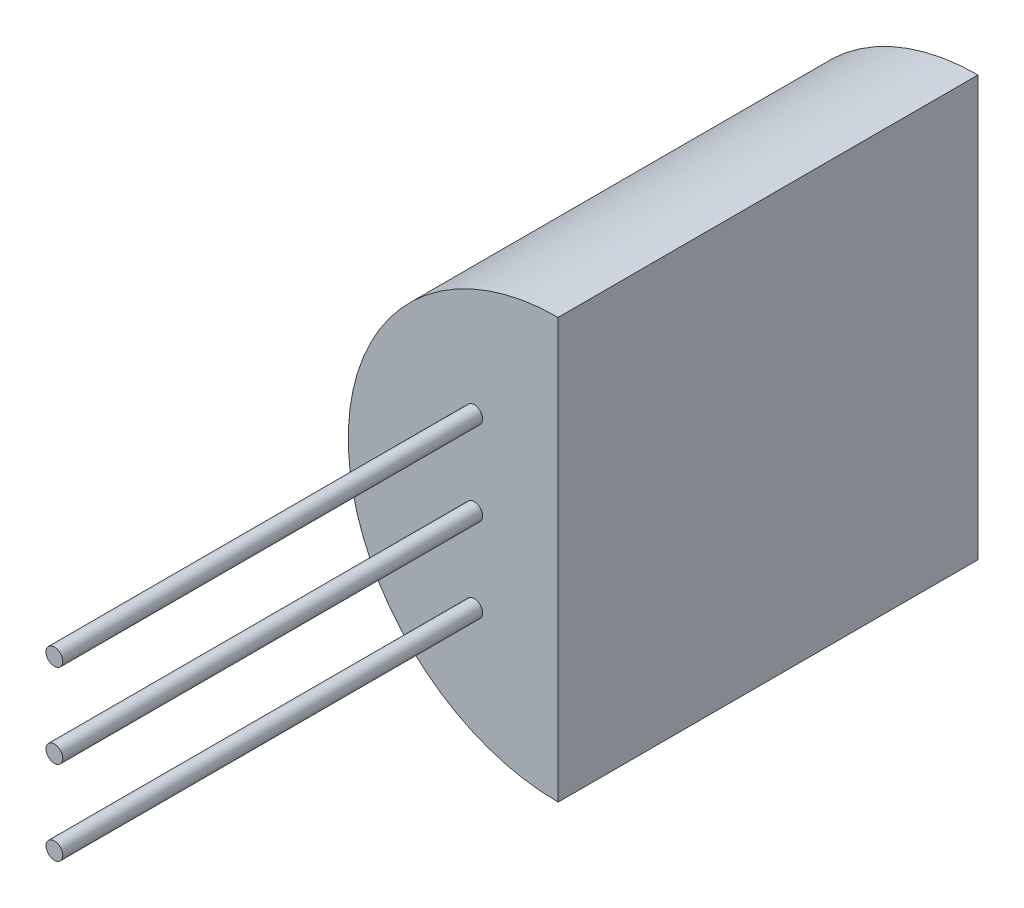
from build123d import *

# Parameters (mm, degrees)
ESQUISSE1_R             = 2.5
BOSS_EXTRU_1_DEPTH      = 5
ENL_V_MAT_EXTRU_1_DEPTH = 5
ESQUISSE3_R             = 0.1
BOSS_EXTRU_2_DEPTH      = 5


with BuildPart() as part:
    # Esquisse1 → Boss.-Extru.1 (new body)
    with BuildSketch(Plane.XY):
        with Locations((-2.023945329, 1.44898769)):
            Circle(ESQUISSE1_R)
    extrude(amount=BOSS_EXTRU_1_DEPTH)

    # Esquisse2 → Enl_v. mat.-Extru.1 (cut)
    with BuildSketch(Plane.XY.offset(5)):
        Polygon((-2.023945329, 25.129327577), (-2.023945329, 3.94898769), (-2.023945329, -1.051012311), (-2.023945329, -22.231352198), (40.336734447, -22.231352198), (40.336734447, 25.129327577), align=None)
    extrude(amount=-ENL_V_MAT_EXTRU_1_DEPTH, mode=Mode.SUBTRACT)

    # Esquisse3 → Boss.-Extru.2 (add)
    with BuildSketch(Plane.XY.offset(5)):
        with Locations((-3.023945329, 2.44898769)):
            Circle(ESQUISSE3_R)
        with Locations((-3.023945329, 1.44898769)):
            Circle(ESQUISSE3_R)
        with Locations((-3.023945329, 0.44898769)):
            Circle(ESQUISSE3_R)
    extrude(amount=BOSS_EXTRU_2_DEPTH)


solid = part.part
